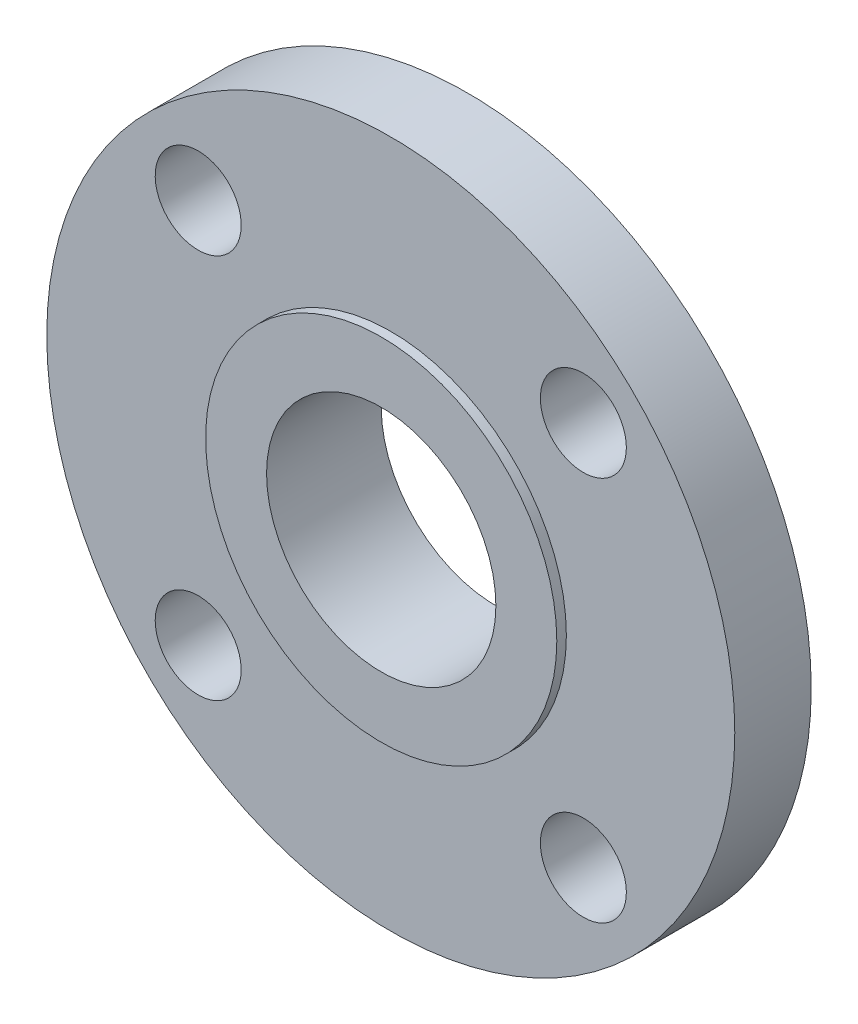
ISO-10303-21;
HEADER;
FILE_DESCRIPTION(('STEP AP214'),'2;1');
FILE_NAME('part.step','',(''),(''),'','','');
FILE_SCHEMA(('AUTOMOTIVE_DESIGN { 1 0 10303 214 1 1 1 1 }'));
ENDSEC;
DATA;
#1=APPLICATION_CONTEXT('core data for automotive mechanical design processes');
#2=APPLICATION_PROTOCOL_DEFINITION('international standard','automotive_design',2000,#1);
#3=PRODUCT_CONTEXT('',#1,'mechanical');
#4=PRODUCT('Part','Part','',(#3));
#5=PRODUCT_RELATED_PRODUCT_CATEGORY('part','',(#4));
#6=PRODUCT_DEFINITION_FORMATION('','',#4);
#7=PRODUCT_DEFINITION_CONTEXT('part definition',#1,'design');
#8=PRODUCT_DEFINITION('design','',#6,#7);
#9=PRODUCT_DEFINITION_SHAPE('','',#8);
#10=(LENGTH_UNIT() NAMED_UNIT(*) SI_UNIT(.MILLI.,.METRE.));
#11=(NAMED_UNIT(*) PLANE_ANGLE_UNIT() SI_UNIT($,.RADIAN.));
#12=(NAMED_UNIT(*) SI_UNIT($,.STERADIAN.) SOLID_ANGLE_UNIT());
#13=UNCERTAINTY_MEASURE_WITH_UNIT(LENGTH_MEASURE(1.E-05),#10,'distance_accuracy_value','');
#14=(GEOMETRIC_REPRESENTATION_CONTEXT(3) GLOBAL_UNCERTAINTY_ASSIGNED_CONTEXT((#13)) GLOBAL_UNIT_ASSIGNED_CONTEXT((#10,
#11,#12)) REPRESENTATION_CONTEXT('',''));
#15=CARTESIAN_POINT('',(0.,0.,0.));
#16=DIRECTION('',(0.,0.,1.));
#17=DIRECTION('',(1.,0.,0.));
#18=AXIS2_PLACEMENT_3D('',#15,#16,#17);
#19=CARTESIAN_POINT('',(0.,0.,-25.4));
#20=DIRECTION('',(0.,0.,1.));
#21=DIRECTION('',(1.,0.,0.));
#22=AXIS2_PLACEMENT_3D('',#19,#20,#21);
#23=CYLINDRICAL_SURFACE('',#22,38.89375);
#24=CARTESIAN_POINT('',(0.,0.,-2.11666666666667));
#25=DIRECTION('',(0.,0.,1.));
#26=DIRECTION('',(1.,0.,0.));
#27=AXIS2_PLACEMENT_3D('',#24,#25,#26);
#28=CIRCLE('',#27,38.89375);
#29=CARTESIAN_POINT('',(38.89375,0.,-2.11666666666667));
#30=VERTEX_POINT('',#29);
#31=EDGE_CURVE('E10',#30,#30,#28,.F.);
#32=ORIENTED_EDGE('',*,*,#31,.F.);
#33=EDGE_LOOP('',(#32));
#34=FACE_BOUND('',#33,.T.);
#35=CARTESIAN_POINT('',(0.,0.,0.));
#36=DIRECTION('',(0.,0.,1.));
#37=DIRECTION('',(1.,0.,0.));
#38=AXIS2_PLACEMENT_3D('',#35,#36,#37);
#39=CIRCLE('',#38,38.89375);
#40=CARTESIAN_POINT('',(38.89375,0.,0.));
#41=VERTEX_POINT('',#40);
#42=EDGE_CURVE('E44',#41,#41,#39,.T.);
#43=ORIENTED_EDGE('',*,*,#42,.F.);
#44=EDGE_LOOP('',(#43));
#45=FACE_BOUND('',#44,.T.);
#46=ADVANCED_FACE('F32',(#34,#45),#23,.T.);
#47=CARTESIAN_POINT('',(0.,0.,0.));
#48=DIRECTION('',(0.,0.,1.));
#49=DIRECTION('',(1.,0.,0.));
#50=AXIS2_PLACEMENT_3D('',#47,#48,#49);
#51=PLANE('',#50);
#52=CARTESIAN_POINT('',(0.,0.,0.));
#53=DIRECTION('',(0.,0.,1.));
#54=DIRECTION('',(1.,0.,0.));
#55=AXIS2_PLACEMENT_3D('',#52,#53,#54);
#56=CIRCLE('',#55,25.4);
#57=CARTESIAN_POINT('',(25.4,0.,0.));
#58=VERTEX_POINT('',#57);
#59=EDGE_CURVE('E52',#58,#58,#56,.T.);
#60=ORIENTED_EDGE('',*,*,#59,.F.);
#61=EDGE_LOOP('',(#60));
#62=FACE_BOUND('',#61,.T.);
#63=ORIENTED_EDGE('',*,*,#42,.T.);
#64=EDGE_LOOP('',(#63));
#65=FACE_BOUND('',#64,.T.);
#66=ADVANCED_FACE('F88',(#62,#65),#51,.T.);
#67=CARTESIAN_POINT('',(0.,0.,-234.57614690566));
#68=DIRECTION('',(0.,0.,1.));
#69=DIRECTION('',(1.,0.,0.));
#70=AXIS2_PLACEMENT_3D('',#67,#68,#69);
#71=CYLINDRICAL_SURFACE('',#70,76.2);
#72=CARTESIAN_POINT('',(0.,0.,-19.05));
#73=DIRECTION('',(0.,0.,1.));
#74=DIRECTION('',(1.,0.,0.));
#75=AXIS2_PLACEMENT_3D('',#72,#73,#74);
#76=CIRCLE('',#75,76.2);
#77=CARTESIAN_POINT('',(76.2,0.,-19.05));
#78=VERTEX_POINT('',#77);
#79=EDGE_CURVE('E56',#78,#78,#76,.F.);
#80=ORIENTED_EDGE('',*,*,#79,.F.);
#81=EDGE_LOOP('',(#80));
#82=FACE_BOUND('',#81,.T.);
#83=CARTESIAN_POINT('',(0.,0.,-2.11666666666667));
#84=DIRECTION('',(0.,0.,1.));
#85=DIRECTION('',(1.,0.,0.));
#86=AXIS2_PLACEMENT_3D('',#83,#84,#85);
#87=CIRCLE('',#86,76.2);
#88=CARTESIAN_POINT('',(76.2,0.,-2.11666666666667));
#89=VERTEX_POINT('',#88);
#90=EDGE_CURVE('E51',#89,#89,#87,.T.);
#91=ORIENTED_EDGE('',*,*,#90,.F.);
#92=EDGE_LOOP('',(#91));
#93=FACE_BOUND('',#92,.T.);
#94=ADVANCED_FACE('F85',(#82,#93),#71,.T.);
#95=CARTESIAN_POINT('',(0.,0.,-2.11666666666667));
#96=DIRECTION('',(0.,0.,1.));
#97=DIRECTION('',(1.,0.,0.));
#98=AXIS2_PLACEMENT_3D('',#95,#96,#97);
#99=PLANE('',#98);
#100=CARTESIAN_POINT('',(42.6562165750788,-42.6562165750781,-2.11666666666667));
#101=DIRECTION('',(0.,0.,1.));
#102=DIRECTION('',(0.,-1.,0.));
#103=AXIS2_PLACEMENT_3D('',#100,#101,#102);
#104=CIRCLE('',#103,9.52500000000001);
#105=CARTESIAN_POINT('',(42.6562165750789,-52.1812165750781,-2.11666666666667));
#106=VERTEX_POINT('',#105);
#107=EDGE_CURVE('E194',#106,#106,#104,.T.);
#108=ORIENTED_EDGE('',*,*,#107,.F.);
#109=EDGE_LOOP('',(#108));
#110=FACE_BOUND('',#109,.T.);
#111=CARTESIAN_POINT('',(-42.6562165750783,-42.6562165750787,-2.11666666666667));
#112=DIRECTION('',(0.,0.,1.));
#113=DIRECTION('',(-1.,0.,0.));
#114=AXIS2_PLACEMENT_3D('',#111,#112,#113);
#115=CIRCLE('',#114,9.52500000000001);
#116=CARTESIAN_POINT('',(-52.1812165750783,-42.6562165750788,-2.11666666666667));
#117=VERTEX_POINT('',#116);
#118=EDGE_CURVE('E188',#117,#117,#115,.T.);
#119=ORIENTED_EDGE('',*,*,#118,.F.);
#120=EDGE_LOOP('',(#119));
#121=FACE_BOUND('',#120,.T.);
#122=CARTESIAN_POINT('',(-42.6562165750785,42.6562165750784,-2.11666666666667));
#123=DIRECTION('',(0.,0.,1.));
#124=DIRECTION('',(0.,1.,0.));
#125=AXIS2_PLACEMENT_3D('',#122,#123,#124);
#126=CIRCLE('',#125,9.52500000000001);
#127=CARTESIAN_POINT('',(-42.6562165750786,52.1812165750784,-2.11666666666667));
#128=VERTEX_POINT('',#127);
#129=EDGE_CURVE('E179',#128,#128,#126,.T.);
#130=ORIENTED_EDGE('',*,*,#129,.F.);
#131=EDGE_LOOP('',(#130));
#132=FACE_BOUND('',#131,.T.);
#133=CARTESIAN_POINT('',(42.6562165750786,42.6562165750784,-2.11666666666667));
#134=DIRECTION('',(0.,0.,1.));
#135=DIRECTION('',(1.,0.,0.));
#136=AXIS2_PLACEMENT_3D('',#133,#134,#135);
#137=CIRCLE('',#136,9.52500000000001);
#138=CARTESIAN_POINT('',(52.1812165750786,42.6562165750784,-2.11666666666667));
#139=VERTEX_POINT('',#138);
#140=EDGE_CURVE('E63',#139,#139,#137,.T.);
#141=ORIENTED_EDGE('',*,*,#140,.F.);
#142=EDGE_LOOP('',(#141));
#143=FACE_BOUND('',#142,.T.);
#144=ORIENTED_EDGE('',*,*,#31,.T.);
#145=EDGE_LOOP('',(#144));
#146=FACE_BOUND('',#145,.T.);
#147=ORIENTED_EDGE('',*,*,#90,.T.);
#148=EDGE_LOOP('',(#147));
#149=FACE_BOUND('',#148,.T.);
#150=ADVANCED_FACE('F80',(#110,#121,#132,#143,#146,#149),#99,.T.);
#151=CARTESIAN_POINT('',(0.,0.,-19.05));
#152=DIRECTION('',(0.,0.,1.));
#153=DIRECTION('',(1.,0.,0.));
#154=AXIS2_PLACEMENT_3D('',#151,#152,#153);
#155=PLANE('',#154);
#156=CARTESIAN_POINT('',(42.6562165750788,-42.6562165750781,-19.05));
#157=DIRECTION('',(0.,0.,1.));
#158=DIRECTION('',(0.,-1.,0.));
#159=AXIS2_PLACEMENT_3D('',#156,#157,#158);
#160=CIRCLE('',#159,9.52500000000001);
#161=CARTESIAN_POINT('',(42.6562165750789,-52.1812165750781,-19.05));
#162=VERTEX_POINT('',#161);
#163=EDGE_CURVE('E191',#162,#162,#160,.T.);
#164=ORIENTED_EDGE('',*,*,#163,.T.);
#165=EDGE_LOOP('',(#164));
#166=FACE_BOUND('',#165,.T.);
#167=CARTESIAN_POINT('',(-42.6562165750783,-42.6562165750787,-19.05));
#168=DIRECTION('',(0.,0.,1.));
#169=DIRECTION('',(-1.,0.,0.));
#170=AXIS2_PLACEMENT_3D('',#167,#168,#169);
#171=CIRCLE('',#170,9.52500000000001);
#172=CARTESIAN_POINT('',(-52.1812165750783,-42.6562165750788,-19.05));
#173=VERTEX_POINT('',#172);
#174=EDGE_CURVE('E183',#173,#173,#171,.T.);
#175=ORIENTED_EDGE('',*,*,#174,.T.);
#176=EDGE_LOOP('',(#175));
#177=FACE_BOUND('',#176,.T.);
#178=CARTESIAN_POINT('',(-42.6562165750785,42.6562165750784,-19.05));
#179=DIRECTION('',(0.,0.,1.));
#180=DIRECTION('',(0.,1.,0.));
#181=AXIS2_PLACEMENT_3D('',#178,#179,#180);
#182=CIRCLE('',#181,9.52500000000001);
#183=CARTESIAN_POINT('',(-42.6562165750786,52.1812165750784,-19.05));
#184=VERTEX_POINT('',#183);
#185=EDGE_CURVE('E177',#184,#184,#182,.T.);
#186=ORIENTED_EDGE('',*,*,#185,.T.);
#187=EDGE_LOOP('',(#186));
#188=FACE_BOUND('',#187,.T.);
#189=CARTESIAN_POINT('',(42.6562165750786,42.6562165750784,-19.05));
#190=DIRECTION('',(0.,0.,1.));
#191=DIRECTION('',(1.,0.,0.));
#192=AXIS2_PLACEMENT_3D('',#189,#190,#191);
#193=CIRCLE('',#192,9.52500000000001);
#194=CARTESIAN_POINT('',(52.1812165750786,42.6562165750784,-19.05));
#195=VERTEX_POINT('',#194);
#196=EDGE_CURVE('E35',#195,#195,#193,.T.);
#197=ORIENTED_EDGE('',*,*,#196,.T.);
#198=EDGE_LOOP('',(#197));
#199=FACE_BOUND('',#198,.T.);
#200=CARTESIAN_POINT('',(0.,0.,-19.05));
#201=DIRECTION('',(0.,0.,1.));
#202=DIRECTION('',(1.,0.,0.));
#203=AXIS2_PLACEMENT_3D('',#200,#201,#202);
#204=CIRCLE('',#203,38.89375);
#205=CARTESIAN_POINT('',(38.89375,0.,-19.05));
#206=VERTEX_POINT('',#205);
#207=EDGE_CURVE('E47',#206,#206,#204,.F.);
#208=ORIENTED_EDGE('',*,*,#207,.F.);
#209=EDGE_LOOP('',(#208));
#210=FACE_BOUND('',#209,.T.);
#211=ORIENTED_EDGE('',*,*,#79,.T.);
#212=EDGE_LOOP('',(#211));
#213=FACE_BOUND('',#212,.T.);
#214=ADVANCED_FACE('F76',(#166,#177,#188,#199,#210,#213),#155,.F.);
#215=CARTESIAN_POINT('',(0.,0.,-25.4));
#216=DIRECTION('',(0.,0.,1.));
#217=DIRECTION('',(1.,0.,0.));
#218=AXIS2_PLACEMENT_3D('',#215,#216,#217);
#219=PLANE('',#218);
#220=CARTESIAN_POINT('',(0.,0.,-25.4));
#221=DIRECTION('',(0.,0.,1.));
#222=DIRECTION('',(1.,0.,0.));
#223=AXIS2_PLACEMENT_3D('',#220,#221,#222);
#224=CIRCLE('',#223,25.4);
#225=CARTESIAN_POINT('',(25.4,0.,-25.4));
#226=VERTEX_POINT('',#225);
#227=EDGE_CURVE('E49',#226,#226,#224,.T.);
#228=ORIENTED_EDGE('',*,*,#227,.T.);
#229=EDGE_LOOP('',(#228));
#230=FACE_BOUND('',#229,.T.);
#231=CARTESIAN_POINT('',(0.,0.,-25.4));
#232=DIRECTION('',(0.,0.,1.));
#233=DIRECTION('',(1.,0.,0.));
#234=AXIS2_PLACEMENT_3D('',#231,#232,#233);
#235=CIRCLE('',#234,38.89375);
#236=CARTESIAN_POINT('',(38.89375,0.,-25.4));
#237=VERTEX_POINT('',#236);
#238=EDGE_CURVE('E39',#237,#237,#235,.T.);
#239=ORIENTED_EDGE('',*,*,#238,.F.);
#240=EDGE_LOOP('',(#239));
#241=FACE_BOUND('',#240,.T.);
#242=ADVANCED_FACE('F79',(#230,#241),#219,.F.);
#243=ORIENTED_EDGE('',*,*,#238,.T.);
#244=EDGE_LOOP('',(#243));
#245=FACE_BOUND('',#244,.T.);
#246=ORIENTED_EDGE('',*,*,#207,.T.);
#247=EDGE_LOOP('',(#246));
#248=FACE_BOUND('',#247,.T.);
#249=ADVANCED_FACE('F74',(#245,#248),#23,.T.);
#250=CARTESIAN_POINT('',(0.,0.,19.5213114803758));
#251=DIRECTION('',(0.,0.,1.));
#252=DIRECTION('',(1.,0.,0.));
#253=AXIS2_PLACEMENT_3D('',#250,#251,#252);
#254=CYLINDRICAL_SURFACE('',#253,25.4);
#255=ORIENTED_EDGE('',*,*,#59,.T.);
#256=EDGE_LOOP('',(#255));
#257=FACE_BOUND('',#256,.T.);
#258=ORIENTED_EDGE('',*,*,#227,.F.);
#259=EDGE_LOOP('',(#258));
#260=FACE_BOUND('',#259,.T.);
#261=ADVANCED_FACE('F107',(#257,#260),#254,.F.);
#262=CARTESIAN_POINT('',(42.6562165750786,42.6562165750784,-25.4));
#263=DIRECTION('',(0.,0.,1.));
#264=DIRECTION('',(1.,0.,0.));
#265=AXIS2_PLACEMENT_3D('',#262,#263,#264);
#266=CYLINDRICAL_SURFACE('',#265,9.52500000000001);
#267=ORIENTED_EDGE('',*,*,#140,.T.);
#268=EDGE_LOOP('',(#267));
#269=FACE_BOUND('',#268,.T.);
#270=ORIENTED_EDGE('',*,*,#196,.F.);
#271=EDGE_LOOP('',(#270));
#272=FACE_BOUND('',#271,.T.);
#273=ADVANCED_FACE('F113',(#269,#272),#266,.F.);
#274=CARTESIAN_POINT('',(-42.6562165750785,42.6562165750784,-25.4));
#275=DIRECTION('',(0.,0.,1.));
#276=DIRECTION('',(0.,1.,0.));
#277=AXIS2_PLACEMENT_3D('',#274,#275,#276);
#278=CYLINDRICAL_SURFACE('',#277,9.52500000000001);
#279=ORIENTED_EDGE('',*,*,#129,.T.);
#280=EDGE_LOOP('',(#279));
#281=FACE_BOUND('',#280,.T.);
#282=ORIENTED_EDGE('',*,*,#185,.F.);
#283=EDGE_LOOP('',(#282));
#284=FACE_BOUND('',#283,.T.);
#285=ADVANCED_FACE('F135',(#281,#284),#278,.F.);
#286=CARTESIAN_POINT('',(-42.6562165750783,-42.6562165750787,-25.4));
#287=DIRECTION('',(0.,0.,1.));
#288=DIRECTION('',(-1.,0.,0.));
#289=AXIS2_PLACEMENT_3D('',#286,#287,#288);
#290=CYLINDRICAL_SURFACE('',#289,9.52500000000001);
#291=ORIENTED_EDGE('',*,*,#118,.T.);
#292=EDGE_LOOP('',(#291));
#293=FACE_BOUND('',#292,.T.);
#294=ORIENTED_EDGE('',*,*,#174,.F.);
#295=EDGE_LOOP('',(#294));
#296=FACE_BOUND('',#295,.T.);
#297=ADVANCED_FACE('F140',(#293,#296),#290,.F.);
#298=CARTESIAN_POINT('',(42.6562165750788,-42.6562165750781,-25.4));
#299=DIRECTION('',(0.,0.,1.));
#300=DIRECTION('',(0.,-1.,0.));
#301=AXIS2_PLACEMENT_3D('',#298,#299,#300);
#302=CYLINDRICAL_SURFACE('',#301,9.52500000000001);
#303=ORIENTED_EDGE('',*,*,#107,.T.);
#304=EDGE_LOOP('',(#303));
#305=FACE_BOUND('',#304,.T.);
#306=ORIENTED_EDGE('',*,*,#163,.F.);
#307=EDGE_LOOP('',(#306));
#308=FACE_BOUND('',#307,.T.);
#309=ADVANCED_FACE('F152',(#305,#308),#302,.F.);
#310=CLOSED_SHELL('',(#46,#66,#94,#150,#214,#242,#249,#261,#273,#285,#297,#309));
#311=MANIFOLD_SOLID_BREP('B2',#310);
#312=ADVANCED_BREP_SHAPE_REPRESENTATION('',(#18,#311),#14);
#313=SHAPE_DEFINITION_REPRESENTATION(#9,#312);
ENDSEC;
END-ISO-10303-21;
